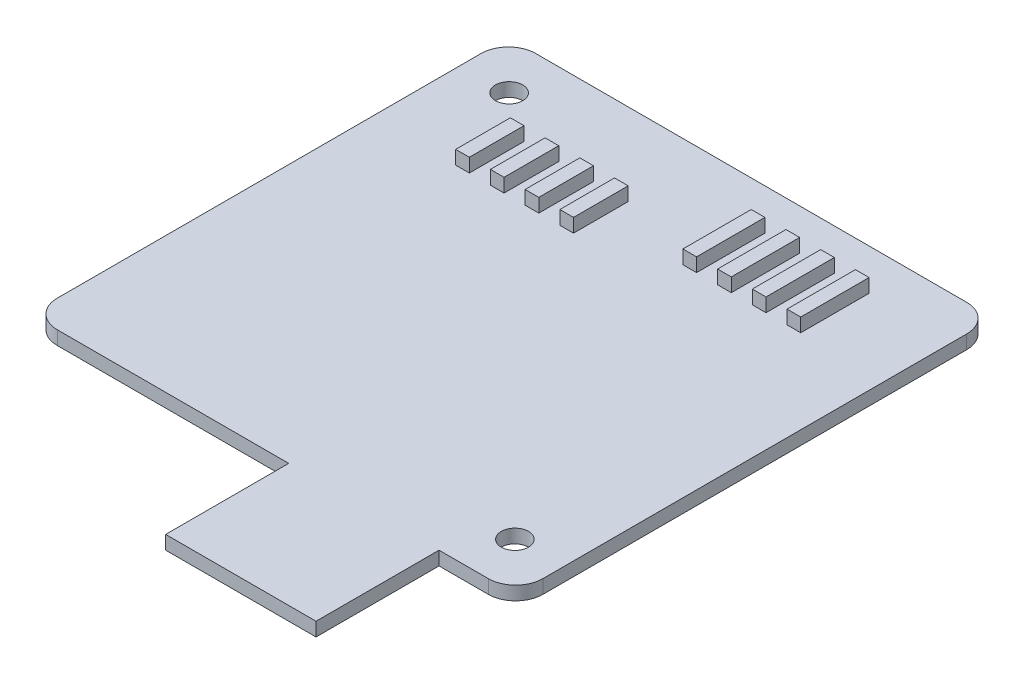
from build123d import *

# Parameters (mm, degrees)
SKETCH1_R           = 1
BOSS_EXTRUDE1_DEPTH = 1
SKETCH2_W           = 1
SKETCH2_H           = 5
SKETCH2_H_2         = 4
BOSS_EXTRUDE2_DEPTH = 1


with BuildPart() as part:
    # Sketch1 → Boss-Extrude1 (new body)
    with BuildSketch(Plane(origin=(0, 0, 0), x_dir=(1, 0, 0), z_dir=(0, 1, 0))):
        with BuildLine():
            Line((-15.763883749, -17.5), (1.164777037, -17.5))
            Line((1.164777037, -17.5), (1.164777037, -26.5))
            Line((1.164777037, -26.5), (12.164777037, -26.5))
            Line((12.164777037, -26.5), (12.164777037, -17.5))
            Line((12.164777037, -17.5), (15.763883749, -17.5))
            ThreePointArc((15.763883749, -17.5), (17.178097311, -16.914213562), (17.763883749, -15.5))
            Line((17.763883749, -15.5), (17.763883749, 15.5))
            ThreePointArc((17.763883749, 15.5), (17.178097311, 16.914213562), (15.763883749, 17.5))
            Line((15.763883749, 17.5), (-15.763883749, 17.5))
            ThreePointArc((-15.763883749, 17.5), (-17.178097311, 16.914213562), (-17.763883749, 15.5))
            Line((-17.763883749, 15.5), (-17.763883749, -15.5))
            ThreePointArc((-17.763883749, -15.5), (-17.178097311, -16.914213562), (-15.763883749, -17.5))
        make_face()
        with Locations(Location((-14.247563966, 14.035915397, 0), (0, 0, 270))):
            Circle(SKETCH1_R, mode=Mode.SUBTRACT)
        with Locations(Location((14.247563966, -14.035915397, 0), (0, 0, 270))):
            Circle(SKETCH1_R, mode=Mode.SUBTRACT)
    extrude(amount=BOSS_EXTRUDE1_DEPTH)

    # Sketch2 → Boss-Extrude2 (add)
    with BuildSketch(Plane(origin=(0, 1, 0), x_dir=(1, 0, 0), z_dir=(0, 1, 0))):
        with Locations((6.04, 12)):
            Rectangle(SKETCH2_W, SKETCH2_H)
        with Locations((3.5, 12)):
            Rectangle(SKETCH2_W, SKETCH2_H)
        with Locations((8.58, 12)):
            Rectangle(SKETCH2_W, SKETCH2_H)
        with Locations((11.12, 12)):
            Rectangle(SKETCH2_W, SKETCH2_H)
        with Locations((-6.04, 9.5)):
            Rectangle(SKETCH2_W, SKETCH2_H_2)
        with Locations((-3.5, 9.5)):
            Rectangle(SKETCH2_W, SKETCH2_H_2)
        with Locations((-8.58, 9.5)):
            Rectangle(SKETCH2_W, SKETCH2_H_2)
        with Locations((-11.12, 9.5)):
            Rectangle(SKETCH2_W, SKETCH2_H_2)
    extrude(amount=BOSS_EXTRUDE2_DEPTH)


solid = part.part
